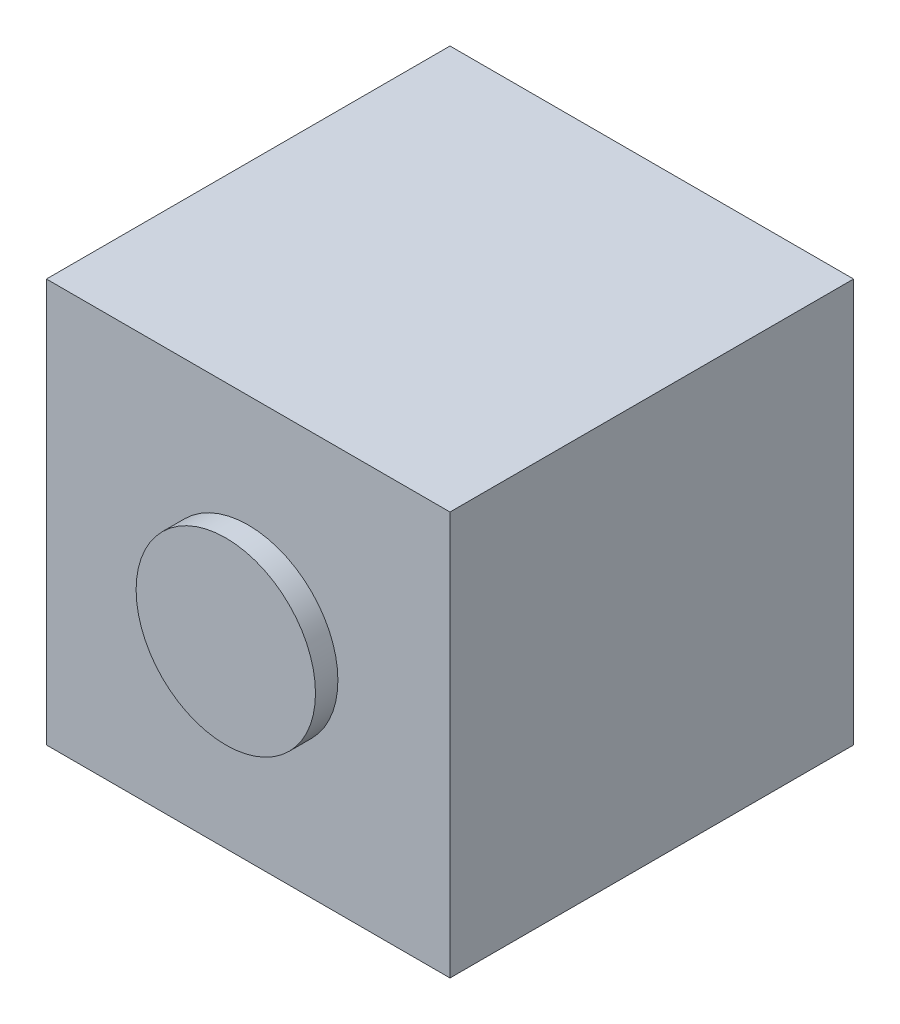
ISO-10303-21;
HEADER;
FILE_DESCRIPTION(('STEP AP214'),'2;1');
FILE_NAME('part.step','',(''),(''),'','','');
FILE_SCHEMA(('AUTOMOTIVE_DESIGN { 1 0 10303 214 1 1 1 1 }'));
ENDSEC;
DATA;
#1=APPLICATION_CONTEXT('core data for automotive mechanical design processes');
#2=APPLICATION_PROTOCOL_DEFINITION('international standard','automotive_design',2000,#1);
#3=PRODUCT_CONTEXT('',#1,'mechanical');
#4=PRODUCT('Part','Part','',(#3));
#5=PRODUCT_RELATED_PRODUCT_CATEGORY('part','',(#4));
#6=PRODUCT_DEFINITION_FORMATION('','',#4);
#7=PRODUCT_DEFINITION_CONTEXT('part definition',#1,'design');
#8=PRODUCT_DEFINITION('design','',#6,#7);
#9=PRODUCT_DEFINITION_SHAPE('','',#8);
#10=(LENGTH_UNIT() NAMED_UNIT(*) SI_UNIT(.MILLI.,.METRE.));
#11=(NAMED_UNIT(*) PLANE_ANGLE_UNIT() SI_UNIT($,.RADIAN.));
#12=(NAMED_UNIT(*) SI_UNIT($,.STERADIAN.) SOLID_ANGLE_UNIT());
#13=UNCERTAINTY_MEASURE_WITH_UNIT(LENGTH_MEASURE(1.E-05),#10,'distance_accuracy_value','');
#14=(GEOMETRIC_REPRESENTATION_CONTEXT(3) GLOBAL_UNCERTAINTY_ASSIGNED_CONTEXT((#13)) GLOBAL_UNIT_ASSIGNED_CONTEXT((#10,
#11,#12)) REPRESENTATION_CONTEXT('',''));
#15=CARTESIAN_POINT('',(0.,0.,0.));
#16=DIRECTION('',(0.,0.,1.));
#17=DIRECTION('',(1.,0.,0.));
#18=AXIS2_PLACEMENT_3D('',#15,#16,#17);
#19=CARTESIAN_POINT('',(227.5,227.5,272.5));
#20=DIRECTION('',(1.,0.,0.));
#21=DIRECTION('',(0.,1.,0.));
#22=AXIS2_PLACEMENT_3D('',#19,#20,#21);
#23=PLANE('',#22);
#24=DIRECTION('',(0.,-1.,0.));
#25=VECTOR('',#24,1.);
#26=CARTESIAN_POINT('',(227.5,227.5,227.5));
#27=LINE('',#26,#25);
#28=CARTESIAN_POINT('',(227.5,272.5,227.5));
#29=VERTEX_POINT('',#28);
#30=CARTESIAN_POINT('',(227.5,227.5,227.5));
#31=VERTEX_POINT('',#30);
#32=EDGE_CURVE('E113',#29,#31,#27,.T.);
#33=ORIENTED_EDGE('',*,*,#32,.T.);
#34=DIRECTION('',(0.,0.,-1.));
#35=VECTOR('',#34,1.);
#36=CARTESIAN_POINT('',(227.5,227.5,272.5));
#37=LINE('',#36,#35);
#38=CARTESIAN_POINT('',(227.5,227.5,272.5));
#39=VERTEX_POINT('',#38);
#40=EDGE_CURVE('E50',#39,#31,#37,.T.);
#41=ORIENTED_EDGE('',*,*,#40,.F.);
#42=DIRECTION('',(0.,-1.,0.));
#43=VECTOR('',#42,1.);
#44=CARTESIAN_POINT('',(227.5,227.5,272.5));
#45=LINE('',#44,#43);
#46=CARTESIAN_POINT('',(227.5,272.5,272.5));
#47=VERTEX_POINT('',#46);
#48=EDGE_CURVE('E100',#47,#39,#45,.T.);
#49=ORIENTED_EDGE('',*,*,#48,.F.);
#50=DIRECTION('',(0.,0.,-1.));
#51=VECTOR('',#50,1.);
#52=CARTESIAN_POINT('',(227.5,272.5,272.5));
#53=LINE('',#52,#51);
#54=EDGE_CURVE('E109',#47,#29,#53,.T.);
#55=ORIENTED_EDGE('',*,*,#54,.T.);
#56=EDGE_LOOP('',(#33,#41,#49,#55));
#57=FACE_BOUND('',#56,.T.);
#58=ADVANCED_FACE('F47',(#57),#23,.F.);
#59=CARTESIAN_POINT('',(227.5,227.5,272.5));
#60=DIRECTION('',(0.,1.,0.));
#61=DIRECTION('',(0.,0.,1.));
#62=AXIS2_PLACEMENT_3D('',#59,#60,#61);
#63=PLANE('',#62);
#64=DIRECTION('',(1.,0.,0.));
#65=VECTOR('',#64,1.);
#66=CARTESIAN_POINT('',(227.5,227.5,227.5));
#67=LINE('',#66,#65);
#68=CARTESIAN_POINT('',(272.5,227.5,227.5));
#69=VERTEX_POINT('',#68);
#70=EDGE_CURVE('E105',#31,#69,#67,.T.);
#71=ORIENTED_EDGE('',*,*,#70,.T.);
#72=DIRECTION('',(0.,0.,-1.));
#73=VECTOR('',#72,1.);
#74=CARTESIAN_POINT('',(272.5,227.5,272.5));
#75=LINE('',#74,#73);
#76=CARTESIAN_POINT('',(272.5,227.5,272.5));
#77=VERTEX_POINT('',#76);
#78=EDGE_CURVE('E103',#77,#69,#75,.T.);
#79=ORIENTED_EDGE('',*,*,#78,.F.);
#80=DIRECTION('',(1.,0.,0.));
#81=VECTOR('',#80,1.);
#82=CARTESIAN_POINT('',(227.5,227.5,272.5));
#83=LINE('',#82,#81);
#84=EDGE_CURVE('E95',#39,#77,#83,.T.);
#85=ORIENTED_EDGE('',*,*,#84,.F.);
#86=ORIENTED_EDGE('',*,*,#40,.T.);
#87=EDGE_LOOP('',(#71,#79,#85,#86));
#88=FACE_BOUND('',#87,.T.);
#89=ADVANCED_FACE('F104',(#88),#63,.F.);
#90=CARTESIAN_POINT('',(272.5,227.5,272.5));
#91=DIRECTION('',(-1.,0.,0.));
#92=DIRECTION('',(0.,-1.,0.));
#93=AXIS2_PLACEMENT_3D('',#90,#91,#92);
#94=PLANE('',#93);
#95=DIRECTION('',(0.,1.,0.));
#96=VECTOR('',#95,1.);
#97=CARTESIAN_POINT('',(272.5,227.5,227.5));
#98=LINE('',#97,#96);
#99=CARTESIAN_POINT('',(272.5,272.5,227.5));
#100=VERTEX_POINT('',#99);
#101=EDGE_CURVE('E81',#69,#100,#98,.T.);
#102=ORIENTED_EDGE('',*,*,#101,.T.);
#103=DIRECTION('',(0.,0.,-1.));
#104=VECTOR('',#103,1.);
#105=CARTESIAN_POINT('',(272.5,272.5,272.5));
#106=LINE('',#105,#104);
#107=CARTESIAN_POINT('',(272.5,272.5,272.5));
#108=VERTEX_POINT('',#107);
#109=EDGE_CURVE('E106',#108,#100,#106,.T.);
#110=ORIENTED_EDGE('',*,*,#109,.F.);
#111=DIRECTION('',(0.,1.,0.));
#112=VECTOR('',#111,1.);
#113=CARTESIAN_POINT('',(272.5,227.5,272.5));
#114=LINE('',#113,#112);
#115=EDGE_CURVE('E98',#77,#108,#114,.T.);
#116=ORIENTED_EDGE('',*,*,#115,.F.);
#117=ORIENTED_EDGE('',*,*,#78,.T.);
#118=EDGE_LOOP('',(#102,#110,#116,#117));
#119=FACE_BOUND('',#118,.T.);
#120=ADVANCED_FACE('F107',(#119),#94,.F.);
#121=CARTESIAN_POINT('',(227.5,272.5,272.5));
#122=DIRECTION('',(0.,-1.,0.));
#123=DIRECTION('',(0.,0.,-1.));
#124=AXIS2_PLACEMENT_3D('',#121,#122,#123);
#125=PLANE('',#124);
#126=DIRECTION('',(-1.,0.,0.));
#127=VECTOR('',#126,1.);
#128=CARTESIAN_POINT('',(227.5,272.5,227.5));
#129=LINE('',#128,#127);
#130=EDGE_CURVE('E87',#100,#29,#129,.T.);
#131=ORIENTED_EDGE('',*,*,#130,.T.);
#132=ORIENTED_EDGE('',*,*,#54,.F.);
#133=DIRECTION('',(-1.,0.,0.));
#134=VECTOR('',#133,1.);
#135=CARTESIAN_POINT('',(227.5,272.5,272.5));
#136=LINE('',#135,#134);
#137=EDGE_CURVE('E64',#108,#47,#136,.T.);
#138=ORIENTED_EDGE('',*,*,#137,.F.);
#139=ORIENTED_EDGE('',*,*,#109,.T.);
#140=EDGE_LOOP('',(#131,#132,#138,#139));
#141=FACE_BOUND('',#140,.T.);
#142=ADVANCED_FACE('F121',(#141),#125,.F.);
#143=CARTESIAN_POINT('',(227.5,227.5,272.5));
#144=DIRECTION('',(0.,0.,-1.));
#145=DIRECTION('',(-1.,0.,0.));
#146=AXIS2_PLACEMENT_3D('',#143,#144,#145);
#147=PLANE('',#146);
#148=CARTESIAN_POINT('',(250.,250.,272.5));
#149=DIRECTION('',(0.,0.,1.));
#150=DIRECTION('',(1.,0.,0.));
#151=AXIS2_PLACEMENT_3D('',#148,#149,#150);
#152=CIRCLE('',#151,10.);
#153=CARTESIAN_POINT('',(260.,250.,272.5));
#154=VERTEX_POINT('',#153);
#155=EDGE_CURVE('E11',#154,#154,#152,.T.);
#156=ORIENTED_EDGE('',*,*,#155,.F.);
#157=EDGE_LOOP('',(#156));
#158=FACE_BOUND('',#157,.T.);
#159=ORIENTED_EDGE('',*,*,#48,.T.);
#160=ORIENTED_EDGE('',*,*,#84,.T.);
#161=ORIENTED_EDGE('',*,*,#115,.T.);
#162=ORIENTED_EDGE('',*,*,#137,.T.);
#163=EDGE_LOOP('',(#159,#160,#161,#162));
#164=FACE_BOUND('',#163,.T.);
#165=ADVANCED_FACE('F96',(#158,#164),#147,.F.);
#166=CARTESIAN_POINT('',(227.5,227.5,227.5));
#167=DIRECTION('',(0.,0.,-1.));
#168=DIRECTION('',(-1.,0.,0.));
#169=AXIS2_PLACEMENT_3D('',#166,#167,#168);
#170=PLANE('',#169);
#171=ORIENTED_EDGE('',*,*,#32,.F.);
#172=ORIENTED_EDGE('',*,*,#130,.F.);
#173=ORIENTED_EDGE('',*,*,#101,.F.);
#174=ORIENTED_EDGE('',*,*,#70,.F.);
#175=EDGE_LOOP('',(#171,#172,#173,#174));
#176=FACE_BOUND('',#175,.T.);
#177=ADVANCED_FACE('F124',(#176),#170,.T.);
#178=CARTESIAN_POINT('',(250.,250.,275.));
#179=DIRECTION('',(0.,0.,-1.));
#180=DIRECTION('',(-1.,0.,0.));
#181=AXIS2_PLACEMENT_3D('',#178,#179,#180);
#182=CYLINDRICAL_SURFACE('',#181,10.);
#183=CARTESIAN_POINT('',(250.,250.,275.));
#184=DIRECTION('',(0.,0.,1.));
#185=DIRECTION('',(1.,0.,0.));
#186=AXIS2_PLACEMENT_3D('',#183,#184,#185);
#187=CIRCLE('',#186,10.);
#188=CARTESIAN_POINT('',(260.,250.,275.));
#189=VERTEX_POINT('',#188);
#190=EDGE_CURVE('E116',#189,#189,#187,.T.);
#191=ORIENTED_EDGE('',*,*,#190,.F.);
#192=EDGE_LOOP('',(#191));
#193=FACE_BOUND('',#192,.T.);
#194=ORIENTED_EDGE('',*,*,#155,.T.);
#195=EDGE_LOOP('',(#194));
#196=FACE_BOUND('',#195,.T.);
#197=ADVANCED_FACE('F132',(#193,#196),#182,.T.);
#198=CARTESIAN_POINT('',(250.,250.,275.));
#199=DIRECTION('',(0.,0.,1.));
#200=DIRECTION('',(1.,0.,0.));
#201=AXIS2_PLACEMENT_3D('',#198,#199,#200);
#202=PLANE('',#201);
#203=ORIENTED_EDGE('',*,*,#190,.T.);
#204=EDGE_LOOP('',(#203));
#205=FACE_BOUND('',#204,.T.);
#206=ADVANCED_FACE('F130',(#205),#202,.T.);
#207=CLOSED_SHELL('',(#58,#89,#120,#142,#165,#177,#197,#206));
#208=MANIFOLD_SOLID_BREP('B2',#207);
#209=ADVANCED_BREP_SHAPE_REPRESENTATION('',(#18,#208),#14);
#210=SHAPE_DEFINITION_REPRESENTATION(#9,#209);
ENDSEC;
END-ISO-10303-21;
